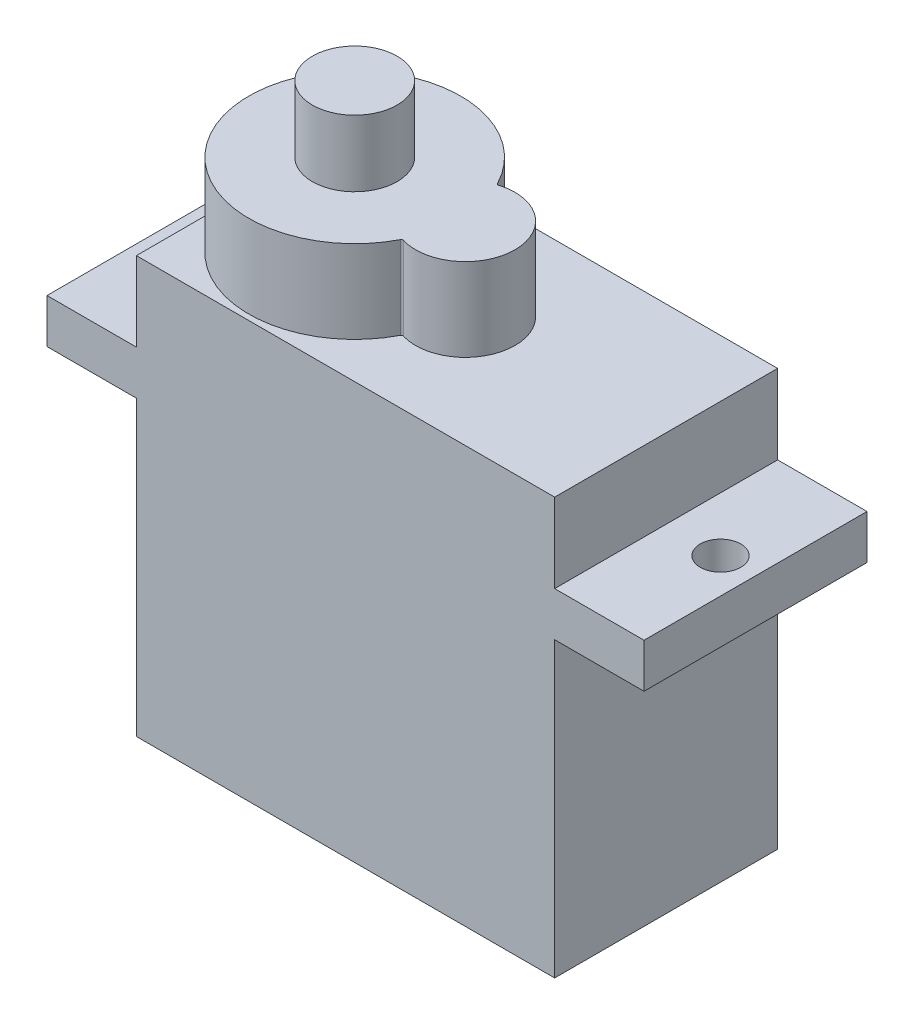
ISO-10303-21;
HEADER;
FILE_DESCRIPTION(('STEP AP214'),'2;1');
FILE_NAME('part.step','',(''),(''),'','','');
FILE_SCHEMA(('AUTOMOTIVE_DESIGN { 1 0 10303 214 1 1 1 1 }'));
ENDSEC;
DATA;
#1=APPLICATION_CONTEXT('core data for automotive mechanical design processes');
#2=APPLICATION_PROTOCOL_DEFINITION('international standard','automotive_design',2000,#1);
#3=PRODUCT_CONTEXT('',#1,'mechanical');
#4=PRODUCT('Part','Part','',(#3));
#5=PRODUCT_RELATED_PRODUCT_CATEGORY('part','',(#4));
#6=PRODUCT_DEFINITION_FORMATION('','',#4);
#7=PRODUCT_DEFINITION_CONTEXT('part definition',#1,'design');
#8=PRODUCT_DEFINITION('design','',#6,#7);
#9=PRODUCT_DEFINITION_SHAPE('','',#8);
#10=(LENGTH_UNIT() NAMED_UNIT(*) SI_UNIT(.MILLI.,.METRE.));
#11=(NAMED_UNIT(*) PLANE_ANGLE_UNIT() SI_UNIT($,.RADIAN.));
#12=(NAMED_UNIT(*) SI_UNIT($,.STERADIAN.) SOLID_ANGLE_UNIT());
#13=UNCERTAINTY_MEASURE_WITH_UNIT(LENGTH_MEASURE(1.E-05),#10,'distance_accuracy_value','');
#14=(GEOMETRIC_REPRESENTATION_CONTEXT(3) GLOBAL_UNCERTAINTY_ASSIGNED_CONTEXT((#13)) GLOBAL_UNIT_ASSIGNED_CONTEXT((#10,
#11,#12)) REPRESENTATION_CONTEXT('',''));
#15=CARTESIAN_POINT('',(0.,0.,0.));
#16=DIRECTION('',(0.,0.,1.));
#17=DIRECTION('',(1.,0.,0.));
#18=AXIS2_PLACEMENT_3D('',#15,#16,#17);
#19=CARTESIAN_POINT('',(0.,0.,12.1));
#20=DIRECTION('',(1.,0.,0.));
#21=DIRECTION('',(0.,1.,0.));
#22=AXIS2_PLACEMENT_3D('',#19,#20,#21);
#23=PLANE('',#22);
#24=DIRECTION('',(0.,-1.,0.));
#25=VECTOR('',#24,1.);
#26=CARTESIAN_POINT('',(0.,0.,0.));
#27=LINE('',#26,#25);
#28=CARTESIAN_POINT('',(0.,0.,0.));
#29=VERTEX_POINT('',#28);
#30=CARTESIAN_POINT('',(0.,-4.3,0.));
#31=VERTEX_POINT('',#30);
#32=EDGE_CURVE('E184',#29,#31,#27,.T.);
#33=ORIENTED_EDGE('',*,*,#32,.T.);
#34=DIRECTION('',(0.,0.,-1.));
#35=VECTOR('',#34,1.);
#36=CARTESIAN_POINT('',(0.,-4.3,12.1));
#37=LINE('',#36,#35);
#38=CARTESIAN_POINT('',(0.,-4.3,12.1));
#39=VERTEX_POINT('',#38);
#40=EDGE_CURVE('E165',#39,#31,#37,.T.);
#41=ORIENTED_EDGE('',*,*,#40,.F.);
#42=DIRECTION('',(0.,-1.,0.));
#43=VECTOR('',#42,1.);
#44=CARTESIAN_POINT('',(0.,0.,12.1));
#45=LINE('',#44,#43);
#46=CARTESIAN_POINT('',(0.,0.,12.1));
#47=VERTEX_POINT('',#46);
#48=EDGE_CURVE('E172',#47,#39,#45,.T.);
#49=ORIENTED_EDGE('',*,*,#48,.F.);
#50=DIRECTION('',(0.,0.,-1.));
#51=VECTOR('',#50,1.);
#52=CARTESIAN_POINT('',(0.,0.,12.1));
#53=LINE('',#52,#51);
#54=EDGE_CURVE('E262',#47,#29,#53,.T.);
#55=ORIENTED_EDGE('',*,*,#54,.T.);
#56=EDGE_LOOP('',(#33,#41,#49,#55));
#57=FACE_BOUND('',#56,.T.);
#58=ADVANCED_FACE('F46',(#57),#23,.F.);
#59=CARTESIAN_POINT('',(0.,-4.3,12.1));
#60=DIRECTION('',(0.,-1.,0.));
#61=DIRECTION('',(1.,0.,0.));
#62=AXIS2_PLACEMENT_3D('',#59,#60,#61);
#63=PLANE('',#62);
#64=CARTESIAN_POINT('',(-2.95,-4.3,6.05));
#65=DIRECTION('',(0.,1.,0.));
#66=DIRECTION('',(-1.,0.,0.));
#67=AXIS2_PLACEMENT_3D('',#64,#65,#66);
#68=CIRCLE('',#67,1.1);
#69=CARTESIAN_POINT('',(-4.05,-4.3,6.05));
#70=VERTEX_POINT('',#69);
#71=EDGE_CURVE('E237',#70,#70,#68,.T.);
#72=ORIENTED_EDGE('',*,*,#71,.F.);
#73=EDGE_LOOP('',(#72));
#74=FACE_BOUND('',#73,.T.);
#75=DIRECTION('',(-1.,0.,0.));
#76=VECTOR('',#75,1.);
#77=CARTESIAN_POINT('',(0.,-4.3,0.));
#78=LINE('',#77,#76);
#79=CARTESIAN_POINT('',(-4.85,-4.3,0.));
#80=VERTEX_POINT('',#79);
#81=EDGE_CURVE('E264',#31,#80,#78,.T.);
#82=ORIENTED_EDGE('',*,*,#81,.T.);
#83=DIRECTION('',(0.,0.,-1.));
#84=VECTOR('',#83,1.);
#85=CARTESIAN_POINT('',(-4.85,-4.3,12.1));
#86=LINE('',#85,#84);
#87=CARTESIAN_POINT('',(-4.85,-4.3,12.1));
#88=VERTEX_POINT('',#87);
#89=EDGE_CURVE('E168',#88,#80,#86,.T.);
#90=ORIENTED_EDGE('',*,*,#89,.F.);
#91=DIRECTION('',(-1.,0.,0.));
#92=VECTOR('',#91,1.);
#93=CARTESIAN_POINT('',(0.,-4.3,12.1));
#94=LINE('',#93,#92);
#95=EDGE_CURVE('E161',#39,#88,#94,.T.);
#96=ORIENTED_EDGE('',*,*,#95,.F.);
#97=ORIENTED_EDGE('',*,*,#40,.T.);
#98=EDGE_LOOP('',(#82,#90,#96,#97));
#99=FACE_BOUND('',#98,.T.);
#100=ADVANCED_FACE('F163',(#74,#99),#63,.F.);
#101=CARTESIAN_POINT('',(-4.85,-4.3,12.1));
#102=DIRECTION('',(1.,0.,0.));
#103=DIRECTION('',(0.,1.,0.));
#104=AXIS2_PLACEMENT_3D('',#101,#102,#103);
#105=PLANE('',#104);
#106=DIRECTION('',(0.,-1.,0.));
#107=VECTOR('',#106,1.);
#108=CARTESIAN_POINT('',(-4.85,-4.3,0.));
#109=LINE('',#108,#107);
#110=CARTESIAN_POINT('',(-4.85,-6.7,0.));
#111=VERTEX_POINT('',#110);
#112=EDGE_CURVE('E266',#80,#111,#109,.T.);
#113=ORIENTED_EDGE('',*,*,#112,.T.);
#114=DIRECTION('',(0.,0.,-1.));
#115=VECTOR('',#114,1.);
#116=CARTESIAN_POINT('',(-4.85,-6.7,12.1));
#117=LINE('',#116,#115);
#118=CARTESIAN_POINT('',(-4.85,-6.7,12.1));
#119=VERTEX_POINT('',#118);
#120=EDGE_CURVE('E189',#119,#111,#117,.T.);
#121=ORIENTED_EDGE('',*,*,#120,.F.);
#122=DIRECTION('',(0.,-1.,0.));
#123=VECTOR('',#122,1.);
#124=CARTESIAN_POINT('',(-4.85,-4.3,12.1));
#125=LINE('',#124,#123);
#126=EDGE_CURVE('E171',#88,#119,#125,.T.);
#127=ORIENTED_EDGE('',*,*,#126,.F.);
#128=ORIENTED_EDGE('',*,*,#89,.T.);
#129=EDGE_LOOP('',(#113,#121,#127,#128));
#130=FACE_BOUND('',#129,.T.);
#131=ADVANCED_FACE('F333',(#130),#105,.F.);
#132=CARTESIAN_POINT('',(-4.85,-6.7,12.1));
#133=DIRECTION('',(0.,1.,0.));
#134=DIRECTION('',(-1.,0.,0.));
#135=AXIS2_PLACEMENT_3D('',#132,#133,#134);
#136=PLANE('',#135);
#137=CARTESIAN_POINT('',(-2.95,-6.7,6.05));
#138=DIRECTION('',(0.,1.,0.));
#139=DIRECTION('',(-1.,0.,0.));
#140=AXIS2_PLACEMENT_3D('',#137,#138,#139);
#141=CIRCLE('',#140,1.1);
#142=CARTESIAN_POINT('',(-4.05,-6.7,6.05));
#143=VERTEX_POINT('',#142);
#144=EDGE_CURVE('E193',#143,#143,#141,.T.);
#145=ORIENTED_EDGE('',*,*,#144,.T.);
#146=EDGE_LOOP('',(#145));
#147=FACE_BOUND('',#146,.T.);
#148=DIRECTION('',(1.,0.,0.));
#149=VECTOR('',#148,1.);
#150=CARTESIAN_POINT('',(-4.85,-6.7,0.));
#151=LINE('',#150,#149);
#152=CARTESIAN_POINT('',(0.,-6.7,0.));
#153=VERTEX_POINT('',#152);
#154=EDGE_CURVE('E268',#111,#153,#151,.T.);
#155=ORIENTED_EDGE('',*,*,#154,.T.);
#156=DIRECTION('',(0.,0.,-1.));
#157=VECTOR('',#156,1.);
#158=CARTESIAN_POINT('',(0.,-6.7,12.1));
#159=LINE('',#158,#157);
#160=CARTESIAN_POINT('',(0.,-6.7,12.1));
#161=VERTEX_POINT('',#160);
#162=EDGE_CURVE('E307',#161,#153,#159,.T.);
#163=ORIENTED_EDGE('',*,*,#162,.F.);
#164=DIRECTION('',(1.,0.,0.));
#165=VECTOR('',#164,1.);
#166=CARTESIAN_POINT('',(-4.85,-6.7,12.1));
#167=LINE('',#166,#165);
#168=EDGE_CURVE('E245',#119,#161,#167,.T.);
#169=ORIENTED_EDGE('',*,*,#168,.F.);
#170=ORIENTED_EDGE('',*,*,#120,.T.);
#171=EDGE_LOOP('',(#155,#163,#169,#170));
#172=FACE_BOUND('',#171,.T.);
#173=ADVANCED_FACE('F314',(#147,#172),#136,.F.);
#174=CARTESIAN_POINT('',(0.,-6.7,12.1));
#175=DIRECTION('',(1.,0.,0.));
#176=DIRECTION('',(0.,1.,0.));
#177=AXIS2_PLACEMENT_3D('',#174,#175,#176);
#178=PLANE('',#177);
#179=DIRECTION('',(0.,-1.,0.));
#180=VECTOR('',#179,1.);
#181=CARTESIAN_POINT('',(0.,-6.7,0.));
#182=LINE('',#181,#180);
#183=CARTESIAN_POINT('',(0.,-22.6,0.));
#184=VERTEX_POINT('',#183);
#185=EDGE_CURVE('E270',#153,#184,#182,.T.);
#186=ORIENTED_EDGE('',*,*,#185,.T.);
#187=DIRECTION('',(0.,0.,-1.));
#188=VECTOR('',#187,1.);
#189=CARTESIAN_POINT('',(0.,-22.6,12.1));
#190=LINE('',#189,#188);
#191=CARTESIAN_POINT('',(0.,-22.6,12.1));
#192=VERTEX_POINT('',#191);
#193=EDGE_CURVE('E304',#192,#184,#190,.T.);
#194=ORIENTED_EDGE('',*,*,#193,.F.);
#195=DIRECTION('',(0.,-1.,0.));
#196=VECTOR('',#195,1.);
#197=CARTESIAN_POINT('',(0.,-6.7,12.1));
#198=LINE('',#197,#196);
#199=EDGE_CURVE('E247',#161,#192,#198,.T.);
#200=ORIENTED_EDGE('',*,*,#199,.F.);
#201=ORIENTED_EDGE('',*,*,#162,.T.);
#202=EDGE_LOOP('',(#186,#194,#200,#201));
#203=FACE_BOUND('',#202,.T.);
#204=ADVANCED_FACE('F325',(#203),#178,.F.);
#205=CARTESIAN_POINT('',(0.,-22.6,12.1));
#206=DIRECTION('',(0.,1.,0.));
#207=DIRECTION('',(0.,0.,1.));
#208=AXIS2_PLACEMENT_3D('',#205,#206,#207);
#209=PLANE('',#208);
#210=DIRECTION('',(1.,0.,0.));
#211=VECTOR('',#210,1.);
#212=CARTESIAN_POINT('',(0.,-22.6,0.));
#213=LINE('',#212,#211);
#214=CARTESIAN_POINT('',(22.7,-22.6,0.));
#215=VERTEX_POINT('',#214);
#216=EDGE_CURVE('E272',#184,#215,#213,.T.);
#217=ORIENTED_EDGE('',*,*,#216,.T.);
#218=DIRECTION('',(0.,0.,-1.));
#219=VECTOR('',#218,1.);
#220=CARTESIAN_POINT('',(22.7,-22.6,12.1));
#221=LINE('',#220,#219);
#222=CARTESIAN_POINT('',(22.7,-22.6,12.1));
#223=VERTEX_POINT('',#222);
#224=EDGE_CURVE('E301',#223,#215,#221,.T.);
#225=ORIENTED_EDGE('',*,*,#224,.F.);
#226=DIRECTION('',(1.,0.,0.));
#227=VECTOR('',#226,1.);
#228=CARTESIAN_POINT('',(0.,-22.6,12.1));
#229=LINE('',#228,#227);
#230=EDGE_CURVE('E249',#192,#223,#229,.T.);
#231=ORIENTED_EDGE('',*,*,#230,.F.);
#232=ORIENTED_EDGE('',*,*,#193,.T.);
#233=EDGE_LOOP('',(#217,#225,#231,#232));
#234=FACE_BOUND('',#233,.T.);
#235=ADVANCED_FACE('F329',(#234),#209,.F.);
#236=CARTESIAN_POINT('',(22.7,-6.7,12.1));
#237=DIRECTION('',(-1.,0.,0.));
#238=DIRECTION('',(0.,-1.,0.));
#239=AXIS2_PLACEMENT_3D('',#236,#237,#238);
#240=PLANE('',#239);
#241=DIRECTION('',(0.,1.,0.));
#242=VECTOR('',#241,1.);
#243=CARTESIAN_POINT('',(22.7,-6.7,0.));
#244=LINE('',#243,#242);
#245=CARTESIAN_POINT('',(22.7,-6.7,0.));
#246=VERTEX_POINT('',#245);
#247=EDGE_CURVE('E274',#215,#246,#244,.T.);
#248=ORIENTED_EDGE('',*,*,#247,.T.);
#249=DIRECTION('',(0.,0.,-1.));
#250=VECTOR('',#249,1.);
#251=CARTESIAN_POINT('',(22.7,-6.7,12.1));
#252=LINE('',#251,#250);
#253=CARTESIAN_POINT('',(22.7,-6.7,12.1));
#254=VERTEX_POINT('',#253);
#255=EDGE_CURVE('E298',#254,#246,#252,.T.);
#256=ORIENTED_EDGE('',*,*,#255,.F.);
#257=DIRECTION('',(0.,1.,0.));
#258=VECTOR('',#257,1.);
#259=CARTESIAN_POINT('',(22.7,-6.7,12.1));
#260=LINE('',#259,#258);
#261=EDGE_CURVE('E251',#223,#254,#260,.T.);
#262=ORIENTED_EDGE('',*,*,#261,.F.);
#263=ORIENTED_EDGE('',*,*,#224,.T.);
#264=EDGE_LOOP('',(#248,#256,#262,#263));
#265=FACE_BOUND('',#264,.T.);
#266=ADVANCED_FACE('F396',(#265),#240,.F.);
#267=CARTESIAN_POINT('',(27.55,-6.7,12.1));
#268=DIRECTION('',(0.,1.,0.));
#269=DIRECTION('',(-1.,0.,0.));
#270=AXIS2_PLACEMENT_3D('',#267,#268,#269);
#271=PLANE('',#270);
#272=CARTESIAN_POINT('',(25.65,-6.7,6.05));
#273=DIRECTION('',(0.,1.,0.));
#274=DIRECTION('',(-1.,0.,0.));
#275=AXIS2_PLACEMENT_3D('',#272,#273,#274);
#276=CIRCLE('',#275,1.1);
#277=CARTESIAN_POINT('',(24.55,-6.7,6.05));
#278=VERTEX_POINT('',#277);
#279=EDGE_CURVE('E195',#278,#278,#276,.T.);
#280=ORIENTED_EDGE('',*,*,#279,.T.);
#281=EDGE_LOOP('',(#280));
#282=FACE_BOUND('',#281,.T.);
#283=DIRECTION('',(1.,0.,0.));
#284=VECTOR('',#283,1.);
#285=CARTESIAN_POINT('',(27.55,-6.7,0.));
#286=LINE('',#285,#284);
#287=CARTESIAN_POINT('',(27.55,-6.7,0.));
#288=VERTEX_POINT('',#287);
#289=EDGE_CURVE('E276',#246,#288,#286,.T.);
#290=ORIENTED_EDGE('',*,*,#289,.T.);
#291=DIRECTION('',(0.,0.,-1.));
#292=VECTOR('',#291,1.);
#293=CARTESIAN_POINT('',(27.55,-6.7,12.1));
#294=LINE('',#293,#292);
#295=CARTESIAN_POINT('',(27.55,-6.7,12.1));
#296=VERTEX_POINT('',#295);
#297=EDGE_CURVE('E295',#296,#288,#294,.T.);
#298=ORIENTED_EDGE('',*,*,#297,.F.);
#299=DIRECTION('',(1.,0.,0.));
#300=VECTOR('',#299,1.);
#301=CARTESIAN_POINT('',(27.55,-6.7,12.1));
#302=LINE('',#301,#300);
#303=EDGE_CURVE('E253',#254,#296,#302,.T.);
#304=ORIENTED_EDGE('',*,*,#303,.F.);
#305=ORIENTED_EDGE('',*,*,#255,.T.);
#306=EDGE_LOOP('',(#290,#298,#304,#305));
#307=FACE_BOUND('',#306,.T.);
#308=ADVANCED_FACE('F392',(#282,#307),#271,.F.);
#309=CARTESIAN_POINT('',(27.55,-4.3,12.1));
#310=DIRECTION('',(-1.,0.,0.));
#311=DIRECTION('',(0.,0.,1.));
#312=AXIS2_PLACEMENT_3D('',#309,#310,#311);
#313=PLANE('',#312);
#314=DIRECTION('',(0.,1.,0.));
#315=VECTOR('',#314,1.);
#316=CARTESIAN_POINT('',(27.55,-4.3,0.));
#317=LINE('',#316,#315);
#318=CARTESIAN_POINT('',(27.55,-4.3,0.));
#319=VERTEX_POINT('',#318);
#320=EDGE_CURVE('E278',#288,#319,#317,.T.);
#321=ORIENTED_EDGE('',*,*,#320,.T.);
#322=DIRECTION('',(0.,0.,-1.));
#323=VECTOR('',#322,1.);
#324=CARTESIAN_POINT('',(27.55,-4.3,12.1));
#325=LINE('',#324,#323);
#326=CARTESIAN_POINT('',(27.55,-4.3,12.1));
#327=VERTEX_POINT('',#326);
#328=EDGE_CURVE('E292',#327,#319,#325,.T.);
#329=ORIENTED_EDGE('',*,*,#328,.F.);
#330=DIRECTION('',(0.,1.,0.));
#331=VECTOR('',#330,1.);
#332=CARTESIAN_POINT('',(27.55,-4.3,12.1));
#333=LINE('',#332,#331);
#334=EDGE_CURVE('E255',#296,#327,#333,.T.);
#335=ORIENTED_EDGE('',*,*,#334,.F.);
#336=ORIENTED_EDGE('',*,*,#297,.T.);
#337=EDGE_LOOP('',(#321,#329,#335,#336));
#338=FACE_BOUND('',#337,.T.);
#339=ADVANCED_FACE('F388',(#338),#313,.F.);
#340=CARTESIAN_POINT('',(22.7,-4.3,12.1));
#341=DIRECTION('',(0.,-1.,0.));
#342=DIRECTION('',(1.,0.,0.));
#343=AXIS2_PLACEMENT_3D('',#340,#341,#342);
#344=PLANE('',#343);
#345=CARTESIAN_POINT('',(25.65,-4.3,6.05));
#346=DIRECTION('',(0.,1.,0.));
#347=DIRECTION('',(1.,0.,0.));
#348=AXIS2_PLACEMENT_3D('',#345,#346,#347);
#349=CIRCLE('',#348,1.1);
#350=CARTESIAN_POINT('',(26.75,-4.3,6.05));
#351=VERTEX_POINT('',#350);
#352=EDGE_CURVE('E219',#351,#351,#349,.T.);
#353=ORIENTED_EDGE('',*,*,#352,.F.);
#354=EDGE_LOOP('',(#353));
#355=FACE_BOUND('',#354,.T.);
#356=DIRECTION('',(-1.,0.,0.));
#357=VECTOR('',#356,1.);
#358=CARTESIAN_POINT('',(22.7,-4.3,0.));
#359=LINE('',#358,#357);
#360=CARTESIAN_POINT('',(22.7,-4.3,0.));
#361=VERTEX_POINT('',#360);
#362=EDGE_CURVE('E280',#319,#361,#359,.T.);
#363=ORIENTED_EDGE('',*,*,#362,.T.);
#364=DIRECTION('',(0.,0.,-1.));
#365=VECTOR('',#364,1.);
#366=CARTESIAN_POINT('',(22.7,-4.3,12.1));
#367=LINE('',#366,#365);
#368=CARTESIAN_POINT('',(22.7,-4.3,12.1));
#369=VERTEX_POINT('',#368);
#370=EDGE_CURVE('E289',#369,#361,#367,.T.);
#371=ORIENTED_EDGE('',*,*,#370,.F.);
#372=DIRECTION('',(-1.,0.,0.));
#373=VECTOR('',#372,1.);
#374=CARTESIAN_POINT('',(22.7,-4.3,12.1));
#375=LINE('',#374,#373);
#376=EDGE_CURVE('E257',#327,#369,#375,.T.);
#377=ORIENTED_EDGE('',*,*,#376,.F.);
#378=ORIENTED_EDGE('',*,*,#328,.T.);
#379=EDGE_LOOP('',(#363,#371,#377,#378));
#380=FACE_BOUND('',#379,.T.);
#381=ADVANCED_FACE('F384',(#355,#380),#344,.F.);
#382=CARTESIAN_POINT('',(22.7,0.,12.1));
#383=DIRECTION('',(-1.,0.,0.));
#384=DIRECTION('',(0.,0.,1.));
#385=AXIS2_PLACEMENT_3D('',#382,#383,#384);
#386=PLANE('',#385);
#387=DIRECTION('',(0.,1.,0.));
#388=VECTOR('',#387,1.);
#389=CARTESIAN_POINT('',(22.7,0.,0.));
#390=LINE('',#389,#388);
#391=CARTESIAN_POINT('',(22.7,0.,0.));
#392=VERTEX_POINT('',#391);
#393=EDGE_CURVE('E282',#361,#392,#390,.T.);
#394=ORIENTED_EDGE('',*,*,#393,.T.);
#395=DIRECTION('',(0.,0.,-1.));
#396=VECTOR('',#395,1.);
#397=CARTESIAN_POINT('',(22.7,0.,12.1));
#398=LINE('',#397,#396);
#399=CARTESIAN_POINT('',(22.7,0.,12.1));
#400=VERTEX_POINT('',#399);
#401=EDGE_CURVE('E286',#400,#392,#398,.T.);
#402=ORIENTED_EDGE('',*,*,#401,.F.);
#403=DIRECTION('',(0.,1.,0.));
#404=VECTOR('',#403,1.);
#405=CARTESIAN_POINT('',(22.7,0.,12.1));
#406=LINE('',#405,#404);
#407=EDGE_CURVE('E259',#369,#400,#406,.T.);
#408=ORIENTED_EDGE('',*,*,#407,.F.);
#409=ORIENTED_EDGE('',*,*,#370,.T.);
#410=EDGE_LOOP('',(#394,#402,#408,#409));
#411=FACE_BOUND('',#410,.T.);
#412=ADVANCED_FACE('F381',(#411),#386,.F.);
#413=CARTESIAN_POINT('',(0.,0.,12.1));
#414=DIRECTION('',(0.,-1.,0.));
#415=DIRECTION('',(0.,0.,-1.));
#416=AXIS2_PLACEMENT_3D('',#413,#414,#415);
#417=PLANE('',#416);
#418=CARTESIAN_POINT('',(5.8,0.,6.05));
#419=DIRECTION('',(0.,1.,0.));
#420=DIRECTION('',(0.,0.,1.));
#421=AXIS2_PLACEMENT_3D('',#418,#419,#420);
#422=CIRCLE('',#421,5.75);
#423=CARTESIAN_POINT('',(10.9096777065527,0.,3.41301427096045));
#424=VERTEX_POINT('',#423);
#425=CARTESIAN_POINT('',(10.9096777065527,0.,8.68698572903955));
#426=VERTEX_POINT('',#425);
#427=EDGE_CURVE('E227',#424,#426,#422,.T.);
#428=ORIENTED_EDGE('',*,*,#427,.F.);
#429=CARTESIAN_POINT('',(10.9985416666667,0.,3.36715364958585));
#430=DIRECTION('',(0.,-1.,0.));
#431=DIRECTION('',(0.,0.,-1.));
#432=AXIS2_PLACEMENT_3D('',#429,#430,#431);
#433=CIRCLE('',#432,0.1);
#434=CARTESIAN_POINT('',(11.0271651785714,0.,3.46296959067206));
#435=VERTEX_POINT('',#434);
#436=EDGE_CURVE('E201',#424,#435,#433,.F.);
#437=ORIENTED_EDGE('',*,*,#436,.T.);
#438=CARTESIAN_POINT('',(11.8,0.,6.05));
#439=DIRECTION('',(0.,1.,0.));
#440=DIRECTION('',(0.,0.,1.));
#441=AXIS2_PLACEMENT_3D('',#438,#439,#440);
#442=CIRCLE('',#441,2.7);
#443=CARTESIAN_POINT('',(11.0271651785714,0.,8.63703040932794));
#444=VERTEX_POINT('',#443);
#445=EDGE_CURVE('E226',#444,#435,#442,.T.);
#446=ORIENTED_EDGE('',*,*,#445,.F.);
#447=CARTESIAN_POINT('',(10.9985416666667,0.,8.73284635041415));
#448=DIRECTION('',(0.,-1.,0.));
#449=DIRECTION('',(0.,0.,-1.));
#450=AXIS2_PLACEMENT_3D('',#447,#448,#449);
#451=CIRCLE('',#450,0.1);
#452=EDGE_CURVE('E199',#444,#426,#451,.F.);
#453=ORIENTED_EDGE('',*,*,#452,.T.);
#454=EDGE_LOOP('',(#428,#437,#446,#453));
#455=FACE_BOUND('',#454,.T.);
#456=DIRECTION('',(-1.,0.,0.));
#457=VECTOR('',#456,1.);
#458=CARTESIAN_POINT('',(0.,0.,0.));
#459=LINE('',#458,#457);
#460=EDGE_CURVE('E181',#392,#29,#459,.T.);
#461=ORIENTED_EDGE('',*,*,#460,.T.);
#462=ORIENTED_EDGE('',*,*,#54,.F.);
#463=DIRECTION('',(-1.,0.,0.));
#464=VECTOR('',#463,1.);
#465=CARTESIAN_POINT('',(0.,0.,12.1));
#466=LINE('',#465,#464);
#467=EDGE_CURVE('E177',#400,#47,#466,.T.);
#468=ORIENTED_EDGE('',*,*,#467,.F.);
#469=ORIENTED_EDGE('',*,*,#401,.T.);
#470=EDGE_LOOP('',(#461,#462,#468,#469));
#471=FACE_BOUND('',#470,.T.);
#472=ADVANCED_FACE('F224',(#455,#471),#417,.F.);
#473=CARTESIAN_POINT('',(0.,0.,12.1));
#474=DIRECTION('',(0.,0.,-1.));
#475=DIRECTION('',(-1.,0.,0.));
#476=AXIS2_PLACEMENT_3D('',#473,#474,#475);
#477=PLANE('',#476);
#478=ORIENTED_EDGE('',*,*,#48,.T.);
#479=ORIENTED_EDGE('',*,*,#95,.T.);
#480=ORIENTED_EDGE('',*,*,#126,.T.);
#481=ORIENTED_EDGE('',*,*,#168,.T.);
#482=ORIENTED_EDGE('',*,*,#199,.T.);
#483=ORIENTED_EDGE('',*,*,#230,.T.);
#484=ORIENTED_EDGE('',*,*,#261,.T.);
#485=ORIENTED_EDGE('',*,*,#303,.T.);
#486=ORIENTED_EDGE('',*,*,#334,.T.);
#487=ORIENTED_EDGE('',*,*,#376,.T.);
#488=ORIENTED_EDGE('',*,*,#407,.T.);
#489=ORIENTED_EDGE('',*,*,#467,.T.);
#490=EDGE_LOOP('',(#478,#479,#480,#481,#482,#483,#484,#485,#486,#487,#488,#489));
#491=FACE_BOUND('',#490,.T.);
#492=ADVANCED_FACE('F175',(#491),#477,.F.);
#493=CARTESIAN_POINT('',(0.,0.,0.));
#494=DIRECTION('',(0.,0.,-1.));
#495=DIRECTION('',(-1.,0.,0.));
#496=AXIS2_PLACEMENT_3D('',#493,#494,#495);
#497=PLANE('',#496);
#498=ORIENTED_EDGE('',*,*,#32,.F.);
#499=ORIENTED_EDGE('',*,*,#460,.F.);
#500=ORIENTED_EDGE('',*,*,#393,.F.);
#501=ORIENTED_EDGE('',*,*,#362,.F.);
#502=ORIENTED_EDGE('',*,*,#320,.F.);
#503=ORIENTED_EDGE('',*,*,#289,.F.);
#504=ORIENTED_EDGE('',*,*,#247,.F.);
#505=ORIENTED_EDGE('',*,*,#216,.F.);
#506=ORIENTED_EDGE('',*,*,#185,.F.);
#507=ORIENTED_EDGE('',*,*,#154,.F.);
#508=ORIENTED_EDGE('',*,*,#112,.F.);
#509=ORIENTED_EDGE('',*,*,#81,.F.);
#510=EDGE_LOOP('',(#498,#499,#500,#501,#502,#503,#504,#505,#506,#507,#508,#509));
#511=FACE_BOUND('',#510,.T.);
#512=ADVANCED_FACE('F320',(#511),#497,.T.);
#513=CARTESIAN_POINT('',(25.65,-16.4,6.05));
#514=DIRECTION('',(0.,1.,0.));
#515=DIRECTION('',(-1.,0.,0.));
#516=AXIS2_PLACEMENT_3D('',#513,#514,#515);
#517=CYLINDRICAL_SURFACE('',#516,1.1);
#518=ORIENTED_EDGE('',*,*,#352,.T.);
#519=EDGE_LOOP('',(#518));
#520=FACE_BOUND('',#519,.T.);
#521=ORIENTED_EDGE('',*,*,#279,.F.);
#522=EDGE_LOOP('',(#521));
#523=FACE_BOUND('',#522,.T.);
#524=ADVANCED_FACE('F370',(#520,#523),#517,.F.);
#525=CARTESIAN_POINT('',(-2.95,-16.4,6.05));
#526=DIRECTION('',(0.,1.,0.));
#527=DIRECTION('',(-1.,0.,0.));
#528=AXIS2_PLACEMENT_3D('',#525,#526,#527);
#529=CYLINDRICAL_SURFACE('',#528,1.1);
#530=ORIENTED_EDGE('',*,*,#71,.T.);
#531=EDGE_LOOP('',(#530));
#532=FACE_BOUND('',#531,.T.);
#533=ORIENTED_EDGE('',*,*,#144,.F.);
#534=EDGE_LOOP('',(#533));
#535=FACE_BOUND('',#534,.T.);
#536=ADVANCED_FACE('F367',(#532,#535),#529,.F.);
#537=CARTESIAN_POINT('',(11.8,4.5,6.05));
#538=DIRECTION('',(0.,-1.,0.));
#539=DIRECTION('',(0.,0.,-1.));
#540=AXIS2_PLACEMENT_3D('',#537,#538,#539);
#541=CYLINDRICAL_SURFACE('',#540,2.7);
#542=ORIENTED_EDGE('',*,*,#445,.T.);
#543=DIRECTION('',(0.,-1.,0.));
#544=VECTOR('',#543,1.);
#545=CARTESIAN_POINT('',(11.0271651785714,4.5,3.46296959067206));
#546=LINE('',#545,#544);
#547=CARTESIAN_POINT('',(11.0271651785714,4.5,3.46296959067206));
#548=VERTEX_POINT('',#547);
#549=EDGE_CURVE('E62',#435,#548,#546,.F.);
#550=ORIENTED_EDGE('',*,*,#549,.T.);
#551=CARTESIAN_POINT('',(11.8,4.5,6.05));
#552=DIRECTION('',(0.,1.,0.));
#553=DIRECTION('',(0.,0.,1.));
#554=AXIS2_PLACEMENT_3D('',#551,#552,#553);
#555=CIRCLE('',#554,2.7);
#556=CARTESIAN_POINT('',(11.0271651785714,4.5,8.63703040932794));
#557=VERTEX_POINT('',#556);
#558=EDGE_CURVE('E211',#557,#548,#555,.T.);
#559=ORIENTED_EDGE('',*,*,#558,.F.);
#560=DIRECTION('',(0.,-1.,0.));
#561=VECTOR('',#560,1.);
#562=CARTESIAN_POINT('',(11.0271651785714,4.5,8.63703040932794));
#563=LINE('',#562,#561);
#564=EDGE_CURVE('E203',#557,#444,#563,.T.);
#565=ORIENTED_EDGE('',*,*,#564,.T.);
#566=EDGE_LOOP('',(#542,#550,#559,#565));
#567=FACE_BOUND('',#566,.T.);
#568=ADVANCED_FACE('F228',(#567),#541,.T.);
#569=CARTESIAN_POINT('',(5.8,4.5,6.05));
#570=DIRECTION('',(0.,-1.,0.));
#571=DIRECTION('',(0.,0.,-1.));
#572=AXIS2_PLACEMENT_3D('',#569,#570,#571);
#573=CYLINDRICAL_SURFACE('',#572,5.75);
#574=CARTESIAN_POINT('',(5.8,4.5,6.05));
#575=DIRECTION('',(0.,1.,0.));
#576=DIRECTION('',(0.,0.,1.));
#577=AXIS2_PLACEMENT_3D('',#574,#575,#576);
#578=CIRCLE('',#577,5.75);
#579=CARTESIAN_POINT('',(10.9096777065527,4.5,3.41301427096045));
#580=VERTEX_POINT('',#579);
#581=CARTESIAN_POINT('',(10.9096777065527,4.5,8.68698572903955));
#582=VERTEX_POINT('',#581);
#583=EDGE_CURVE('E210',#580,#582,#578,.T.);
#584=ORIENTED_EDGE('',*,*,#583,.F.);
#585=DIRECTION('',(0.,-1.,0.));
#586=VECTOR('',#585,1.);
#587=CARTESIAN_POINT('',(10.9096777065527,4.5,3.41301427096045));
#588=LINE('',#587,#586);
#589=EDGE_CURVE('E187',#580,#424,#588,.T.);
#590=ORIENTED_EDGE('',*,*,#589,.T.);
#591=ORIENTED_EDGE('',*,*,#427,.T.);
#592=DIRECTION('',(0.,-1.,0.));
#593=VECTOR('',#592,1.);
#594=CARTESIAN_POINT('',(10.9096777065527,4.5,8.68698572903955));
#595=LINE('',#594,#593);
#596=EDGE_CURVE('E185',#426,#582,#595,.F.);
#597=ORIENTED_EDGE('',*,*,#596,.T.);
#598=EDGE_LOOP('',(#584,#590,#591,#597));
#599=FACE_BOUND('',#598,.T.);
#600=ADVANCED_FACE('F215',(#599),#573,.T.);
#601=CARTESIAN_POINT('',(8.8,4.5,6.05));
#602=DIRECTION('',(0.,1.,0.));
#603=DIRECTION('',(0.,0.,1.));
#604=AXIS2_PLACEMENT_3D('',#601,#602,#603);
#605=PLANE('',#604);
#606=CARTESIAN_POINT('',(5.8,4.5,6.05));
#607=DIRECTION('',(0.,1.,0.));
#608=DIRECTION('',(0.,0.,1.));
#609=AXIS2_PLACEMENT_3D('',#606,#607,#608);
#610=CIRCLE('',#609,2.3);
#611=CARTESIAN_POINT('',(5.8,4.5,8.35));
#612=VERTEX_POINT('',#611);
#613=EDGE_CURVE('E11',#612,#612,#610,.T.);
#614=ORIENTED_EDGE('',*,*,#613,.F.);
#615=EDGE_LOOP('',(#614));
#616=FACE_BOUND('',#615,.T.);
#617=ORIENTED_EDGE('',*,*,#583,.T.);
#618=CARTESIAN_POINT('',(10.9985416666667,4.5,8.73284635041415));
#619=DIRECTION('',(0.,1.,0.));
#620=DIRECTION('',(0.,0.,1.));
#621=AXIS2_PLACEMENT_3D('',#618,#619,#620);
#622=CIRCLE('',#621,0.1);
#623=EDGE_CURVE('E50',#582,#557,#622,.F.);
#624=ORIENTED_EDGE('',*,*,#623,.T.);
#625=ORIENTED_EDGE('',*,*,#558,.T.);
#626=CARTESIAN_POINT('',(10.9985416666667,4.5,3.36715364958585));
#627=DIRECTION('',(0.,1.,0.));
#628=DIRECTION('',(0.,0.,1.));
#629=AXIS2_PLACEMENT_3D('',#626,#627,#628);
#630=CIRCLE('',#629,0.1);
#631=EDGE_CURVE('E206',#548,#580,#630,.F.);
#632=ORIENTED_EDGE('',*,*,#631,.T.);
#633=EDGE_LOOP('',(#617,#624,#625,#632));
#634=FACE_BOUND('',#633,.T.);
#635=ADVANCED_FACE('F209',(#616,#634),#605,.T.);
#636=CARTESIAN_POINT('',(10.9985416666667,4.5,3.36715364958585));
#637=DIRECTION('',(0.,1.,0.));
#638=DIRECTION('',(0.,0.,1.));
#639=AXIS2_PLACEMENT_3D('',#636,#637,#638);
#640=CYLINDRICAL_SURFACE('',#639,0.1);
#641=ORIENTED_EDGE('',*,*,#631,.F.);
#642=ORIENTED_EDGE('',*,*,#549,.F.);
#643=ORIENTED_EDGE('',*,*,#436,.F.);
#644=ORIENTED_EDGE('',*,*,#589,.F.);
#645=EDGE_LOOP('',(#641,#642,#643,#644));
#646=FACE_BOUND('',#645,.T.);
#647=ADVANCED_FACE('F221',(#646),#640,.F.);
#648=CARTESIAN_POINT('',(10.9985416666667,4.5,8.73284635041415));
#649=DIRECTION('',(0.,1.,0.));
#650=DIRECTION('',(0.,0.,1.));
#651=AXIS2_PLACEMENT_3D('',#648,#649,#650);
#652=CYLINDRICAL_SURFACE('',#651,0.1);
#653=ORIENTED_EDGE('',*,*,#623,.F.);
#654=ORIENTED_EDGE('',*,*,#596,.F.);
#655=ORIENTED_EDGE('',*,*,#452,.F.);
#656=ORIENTED_EDGE('',*,*,#564,.F.);
#657=EDGE_LOOP('',(#653,#654,#655,#656));
#658=FACE_BOUND('',#657,.T.);
#659=ADVANCED_FACE('F48',(#658),#652,.F.);
#660=CARTESIAN_POINT('',(5.8,8.1,6.05));
#661=DIRECTION('',(0.,-1.,0.));
#662=DIRECTION('',(0.,0.,-1.));
#663=AXIS2_PLACEMENT_3D('',#660,#661,#662);
#664=CYLINDRICAL_SURFACE('',#663,2.3);
#665=CARTESIAN_POINT('',(5.8,8.1,6.05));
#666=DIRECTION('',(0.,1.,0.));
#667=DIRECTION('',(0.,0.,1.));
#668=AXIS2_PLACEMENT_3D('',#665,#666,#667);
#669=CIRCLE('',#668,2.3);
#670=CARTESIAN_POINT('',(5.8,8.1,8.35));
#671=VERTEX_POINT('',#670);
#672=EDGE_CURVE('E230',#671,#671,#669,.T.);
#673=ORIENTED_EDGE('',*,*,#672,.F.);
#674=EDGE_LOOP('',(#673));
#675=FACE_BOUND('',#674,.T.);
#676=ORIENTED_EDGE('',*,*,#613,.T.);
#677=EDGE_LOOP('',(#676));
#678=FACE_BOUND('',#677,.T.);
#679=ADVANCED_FACE('F353',(#675,#678),#664,.T.);
#680=CARTESIAN_POINT('',(5.8,8.1,6.05));
#681=DIRECTION('',(0.,1.,0.));
#682=DIRECTION('',(0.,0.,1.));
#683=AXIS2_PLACEMENT_3D('',#680,#681,#682);
#684=PLANE('',#683);
#685=ORIENTED_EDGE('',*,*,#672,.T.);
#686=EDGE_LOOP('',(#685));
#687=FACE_BOUND('',#686,.T.);
#688=ADVANCED_FACE('F484',(#687),#684,.T.);
#689=CLOSED_SHELL('',(#58,#100,#131,#173,#204,#235,#266,#308,#339,#381,#412,#472,#492,#512,#524,
#536,#568,#600,#635,#647,#659,#679,#688));
#690=MANIFOLD_SOLID_BREP('B2',#689);
#691=ADVANCED_BREP_SHAPE_REPRESENTATION('',(#18,#690),#14);
#692=SHAPE_DEFINITION_REPRESENTATION(#9,#691);
ENDSEC;
END-ISO-10303-21;
